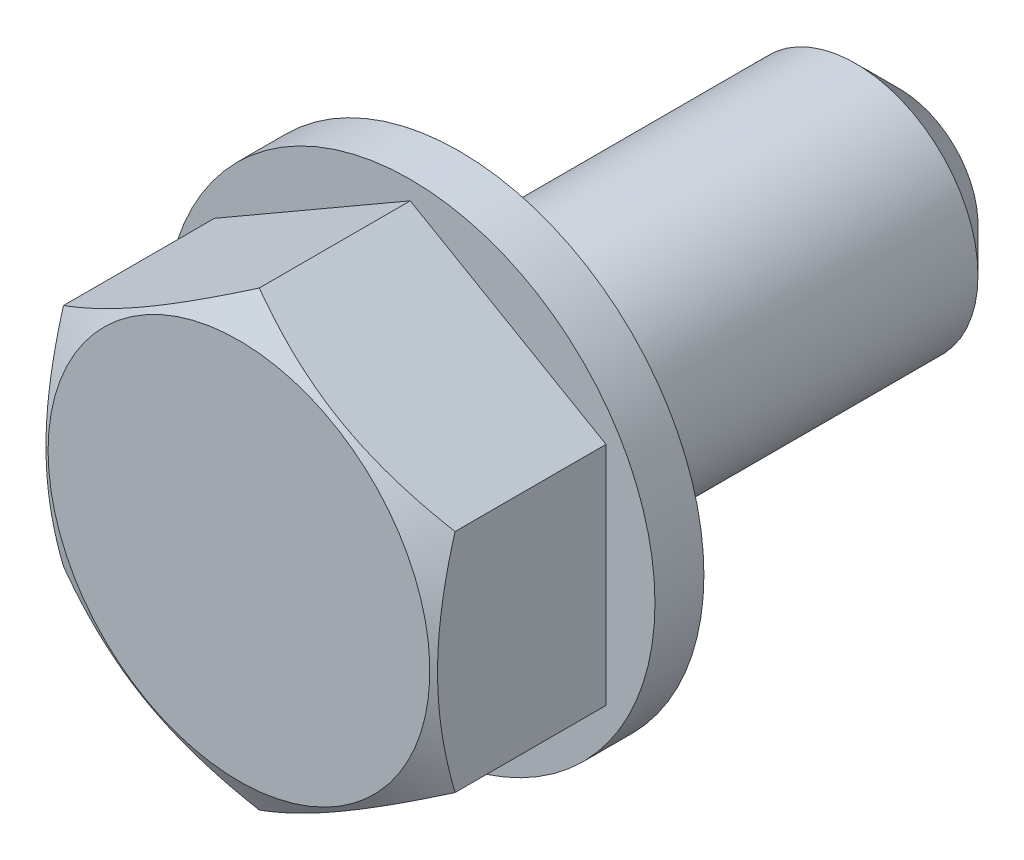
ISO-10303-21;
HEADER;
FILE_DESCRIPTION(('STEP AP214'),'2;1');
FILE_NAME('part.step','',(''),(''),'','','');
FILE_SCHEMA(('AUTOMOTIVE_DESIGN { 1 0 10303 214 1 1 1 1 }'));
ENDSEC;
DATA;
#1=APPLICATION_CONTEXT('core data for automotive mechanical design processes');
#2=APPLICATION_PROTOCOL_DEFINITION('international standard','automotive_design',2000,#1);
#3=PRODUCT_CONTEXT('',#1,'mechanical');
#4=PRODUCT('Part','Part','',(#3));
#5=PRODUCT_RELATED_PRODUCT_CATEGORY('part','',(#4));
#6=PRODUCT_DEFINITION_FORMATION('','',#4);
#7=PRODUCT_DEFINITION_CONTEXT('part definition',#1,'design');
#8=PRODUCT_DEFINITION('design','',#6,#7);
#9=PRODUCT_DEFINITION_SHAPE('','',#8);
#10=(LENGTH_UNIT() NAMED_UNIT(*) SI_UNIT(.MILLI.,.METRE.));
#11=(NAMED_UNIT(*) PLANE_ANGLE_UNIT() SI_UNIT($,.RADIAN.));
#12=(NAMED_UNIT(*) SI_UNIT($,.STERADIAN.) SOLID_ANGLE_UNIT());
#13=UNCERTAINTY_MEASURE_WITH_UNIT(LENGTH_MEASURE(1.E-05),#10,'distance_accuracy_value','');
#14=(GEOMETRIC_REPRESENTATION_CONTEXT(3) GLOBAL_UNCERTAINTY_ASSIGNED_CONTEXT((#13)) GLOBAL_UNIT_ASSIGNED_CONTEXT((#10,
#11,#12)) REPRESENTATION_CONTEXT('',''));
#15=CARTESIAN_POINT('',(0.,0.,0.));
#16=DIRECTION('',(0.,0.,1.));
#17=DIRECTION('',(1.,0.,0.));
#18=AXIS2_PLACEMENT_3D('',#15,#16,#17);
#19=CARTESIAN_POINT('',(0.,4.61880215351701,1.));
#20=DIRECTION('',(0.,0.,1.));
#21=DIRECTION('',(1.,0.,0.));
#22=AXIS2_PLACEMENT_3D('',#19,#20,#21);
#23=PLANE('',#22);
#24=CARTESIAN_POINT('',(0.,0.,1.));
#25=DIRECTION('',(0.,0.,-1.));
#26=DIRECTION('',(-1.,0.,0.));
#27=AXIS2_PLACEMENT_3D('',#24,#25,#26);
#28=CIRCLE('',#27,2.65);
#29=CARTESIAN_POINT('',(-2.65,0.,1.));
#30=VERTEX_POINT('',#29);
#31=EDGE_CURVE('E338',#30,#30,#28,.T.);
#32=ORIENTED_EDGE('',*,*,#31,.T.);
#33=EDGE_LOOP('',(#32));
#34=FACE_BOUND('',#33,.T.);
#35=CARTESIAN_POINT('',(0.,0.,1.));
#36=DIRECTION('',(0.,0.,1.));
#37=DIRECTION('',(1.,0.,0.));
#38=AXIS2_PLACEMENT_3D('',#35,#36,#37);
#39=CIRCLE('',#38,2.5);
#40=CARTESIAN_POINT('',(2.5,0.,1.));
#41=VERTEX_POINT('',#40);
#42=EDGE_CURVE('E102',#41,#41,#39,.F.);
#43=ORIENTED_EDGE('',*,*,#42,.F.);
#44=EDGE_LOOP('',(#43));
#45=FACE_BOUND('',#44,.T.);
#46=ADVANCED_FACE('F14',(#34,#45),#23,.F.);
#47=CARTESIAN_POINT('',(0.,0.,-9.));
#48=DIRECTION('',(0.,0.,1.));
#49=DIRECTION('',(1.,0.,0.));
#50=AXIS2_PLACEMENT_3D('',#47,#48,#49);
#51=CYLINDRICAL_SURFACE('',#50,2.5);
#52=CARTESIAN_POINT('',(0.,0.,-8.1));
#53=DIRECTION('',(0.,0.,-1.));
#54=DIRECTION('',(-1.,0.,0.));
#55=AXIS2_PLACEMENT_3D('',#52,#53,#54);
#56=CIRCLE('',#55,2.5);
#57=CARTESIAN_POINT('',(-2.5,0.,-8.1));
#58=VERTEX_POINT('',#57);
#59=EDGE_CURVE('E9',#58,#58,#56,.F.);
#60=ORIENTED_EDGE('',*,*,#59,.T.);
#61=EDGE_LOOP('',(#60));
#62=FACE_BOUND('',#61,.T.);
#63=ORIENTED_EDGE('',*,*,#42,.T.);
#64=EDGE_LOOP('',(#63));
#65=FACE_BOUND('',#64,.T.);
#66=ADVANCED_FACE('F120',(#62,#65),#51,.T.);
#67=CARTESIAN_POINT('',(0.,0.,-9.));
#68=DIRECTION('',(0.,0.,-1.));
#69=DIRECTION('',(-1.,0.,0.));
#70=AXIS2_PLACEMENT_3D('',#67,#68,#69);
#71=PLANE('',#70);
#72=CARTESIAN_POINT('',(0.,0.,-9.));
#73=DIRECTION('',(0.,0.,-1.));
#74=DIRECTION('',(-1.,0.,0.));
#75=AXIS2_PLACEMENT_3D('',#72,#73,#74);
#76=CIRCLE('',#75,1.6);
#77=CARTESIAN_POINT('',(-1.6,0.,-9.));
#78=VERTEX_POINT('',#77);
#79=EDGE_CURVE('E22',#78,#78,#76,.T.);
#80=ORIENTED_EDGE('',*,*,#79,.T.);
#81=EDGE_LOOP('',(#80));
#82=FACE_BOUND('',#81,.T.);
#83=ADVANCED_FACE('F107',(#82),#71,.T.);
#84=CARTESIAN_POINT('',(0.,0.,-9.));
#85=DIRECTION('',(0.,0.,1.));
#86=DIRECTION('',(1.,0.,0.));
#87=AXIS2_PLACEMENT_3D('',#84,#85,#86);
#88=CONICAL_SURFACE('',#87,1.6,0.785398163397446);
#89=ORIENTED_EDGE('',*,*,#59,.F.);
#90=EDGE_LOOP('',(#89));
#91=FACE_BOUND('',#90,.T.);
#92=ORIENTED_EDGE('',*,*,#79,.F.);
#93=EDGE_LOOP('',(#92));
#94=FACE_BOUND('',#93,.T.);
#95=ADVANCED_FACE('F16',(#91,#94),#88,.T.);
#96=CARTESIAN_POINT('',(0.,0.,1.));
#97=DIRECTION('',(0.,0.,-1.));
#98=DIRECTION('',(-1.,0.,0.));
#99=AXIS2_PLACEMENT_3D('',#96,#97,#98);
#100=PLANE('',#99);
#101=CARTESIAN_POINT('',(0.,0.,1.));
#102=DIRECTION('',(0.,0.,-1.));
#103=DIRECTION('',(-1.,0.,0.));
#104=AXIS2_PLACEMENT_3D('',#101,#102,#103);
#105=CIRCLE('',#104,5.);
#106=CARTESIAN_POINT('',(-5.,0.,1.));
#107=VERTEX_POINT('',#106);
#108=EDGE_CURVE('E337',#107,#107,#105,.T.);
#109=ORIENTED_EDGE('',*,*,#108,.F.);
#110=EDGE_LOOP('',(#109));
#111=FACE_BOUND('',#110,.T.);
#112=DIRECTION('',(-0.866025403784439,-0.5,0.));
#113=VECTOR('',#112,1.);
#114=CARTESIAN_POINT('',(0.,4.61880215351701,1.));
#115=LINE('',#114,#113);
#116=CARTESIAN_POINT('',(0.,4.61880215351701,1.));
#117=VERTEX_POINT('',#116);
#118=CARTESIAN_POINT('',(-4.,2.30940107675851,1.));
#119=VERTEX_POINT('',#118);
#120=EDGE_CURVE('E210',#117,#119,#115,.T.);
#121=ORIENTED_EDGE('',*,*,#120,.F.);
#122=DIRECTION('',(-0.866025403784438,0.5,0.));
#123=VECTOR('',#122,1.);
#124=CARTESIAN_POINT('',(4.,2.30940107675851,1.));
#125=LINE('',#124,#123);
#126=CARTESIAN_POINT('',(4.,2.30940107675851,1.));
#127=VERTEX_POINT('',#126);
#128=EDGE_CURVE('E37',#127,#117,#125,.T.);
#129=ORIENTED_EDGE('',*,*,#128,.F.);
#130=DIRECTION('',(0.,1.,0.));
#131=VECTOR('',#130,1.);
#132=CARTESIAN_POINT('',(4.,-2.30940107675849,1.));
#133=LINE('',#132,#131);
#134=CARTESIAN_POINT('',(4.,-2.30940107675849,1.));
#135=VERTEX_POINT('',#134);
#136=EDGE_CURVE('E65',#135,#127,#133,.T.);
#137=ORIENTED_EDGE('',*,*,#136,.F.);
#138=DIRECTION('',(0.866025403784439,0.5,0.));
#139=VECTOR('',#138,1.);
#140=CARTESIAN_POINT('',(0.,-4.618802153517,1.));
#141=LINE('',#140,#139);
#142=CARTESIAN_POINT('',(0.,-4.618802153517,1.));
#143=VERTEX_POINT('',#142);
#144=EDGE_CURVE('E69',#143,#135,#141,.T.);
#145=ORIENTED_EDGE('',*,*,#144,.F.);
#146=DIRECTION('',(0.866025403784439,-0.5,0.));
#147=VECTOR('',#146,1.);
#148=CARTESIAN_POINT('',(-4.,-2.3094010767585,1.));
#149=LINE('',#148,#147);
#150=CARTESIAN_POINT('',(-4.,-2.3094010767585,1.));
#151=VERTEX_POINT('',#150);
#152=EDGE_CURVE('E85',#151,#143,#149,.T.);
#153=ORIENTED_EDGE('',*,*,#152,.F.);
#154=DIRECTION('',(0.,-1.,0.));
#155=VECTOR('',#154,1.);
#156=CARTESIAN_POINT('',(-4.,2.30940107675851,1.));
#157=LINE('',#156,#155);
#158=EDGE_CURVE('E87',#119,#151,#157,.T.);
#159=ORIENTED_EDGE('',*,*,#158,.F.);
#160=EDGE_LOOP('',(#121,#129,#137,#145,#153,#159));
#161=FACE_BOUND('',#160,.T.);
#162=ADVANCED_FACE('F67',(#111,#161),#100,.F.);
#163=CARTESIAN_POINT('',(0.,0.,0.));
#164=DIRECTION('',(0.,0.,-1.));
#165=DIRECTION('',(-1.,0.,0.));
#166=AXIS2_PLACEMENT_3D('',#163,#164,#165);
#167=PLANE('',#166);
#168=CARTESIAN_POINT('',(0.,0.,0.));
#169=DIRECTION('',(0.,0.,-1.));
#170=DIRECTION('',(-1.,0.,0.));
#171=AXIS2_PLACEMENT_3D('',#168,#169,#170);
#172=CIRCLE('',#171,5.);
#173=CARTESIAN_POINT('',(-5.,0.,0.));
#174=VERTEX_POINT('',#173);
#175=EDGE_CURVE('E333',#174,#174,#172,.T.);
#176=ORIENTED_EDGE('',*,*,#175,.T.);
#177=EDGE_LOOP('',(#176));
#178=FACE_BOUND('',#177,.T.);
#179=CARTESIAN_POINT('',(0.,0.,0.));
#180=DIRECTION('',(0.,0.,-1.));
#181=DIRECTION('',(-1.,0.,0.));
#182=AXIS2_PLACEMENT_3D('',#179,#180,#181);
#183=CIRCLE('',#182,2.65);
#184=CARTESIAN_POINT('',(-2.65,0.,0.));
#185=VERTEX_POINT('',#184);
#186=EDGE_CURVE('E336',#185,#185,#183,.T.);
#187=ORIENTED_EDGE('',*,*,#186,.F.);
#188=EDGE_LOOP('',(#187));
#189=FACE_BOUND('',#188,.T.);
#190=ADVANCED_FACE('F117',(#178,#189),#167,.T.);
#191=CARTESIAN_POINT('',(0.,0.,0.));
#192=DIRECTION('',(0.,0.,1.));
#193=DIRECTION('',(1.,0.,0.));
#194=AXIS2_PLACEMENT_3D('',#191,#192,#193);
#195=CYLINDRICAL_SURFACE('',#194,5.);
#196=ORIENTED_EDGE('',*,*,#175,.F.);
#197=EDGE_LOOP('',(#196));
#198=FACE_BOUND('',#197,.T.);
#199=ORIENTED_EDGE('',*,*,#108,.T.);
#200=EDGE_LOOP('',(#199));
#201=FACE_BOUND('',#200,.T.);
#202=ADVANCED_FACE('F260',(#198,#201),#195,.T.);
#203=CARTESIAN_POINT('',(0.,0.,0.));
#204=DIRECTION('',(0.,0.,1.));
#205=DIRECTION('',(1.,0.,0.));
#206=AXIS2_PLACEMENT_3D('',#203,#204,#205);
#207=CYLINDRICAL_SURFACE('',#206,2.65);
#208=ORIENTED_EDGE('',*,*,#186,.T.);
#209=EDGE_LOOP('',(#208));
#210=FACE_BOUND('',#209,.T.);
#211=ORIENTED_EDGE('',*,*,#31,.F.);
#212=EDGE_LOOP('',(#211));
#213=FACE_BOUND('',#212,.T.);
#214=ADVANCED_FACE('F252',(#210,#213),#207,.F.);
#215=CARTESIAN_POINT('',(0.,4.61880215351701,4.5));
#216=DIRECTION('',(0.,0.,1.));
#217=DIRECTION('',(1.,0.,0.));
#218=AXIS2_PLACEMENT_3D('',#215,#216,#217);
#219=PLANE('',#218);
#220=CARTESIAN_POINT('',(0.,0.,4.5));
#221=DIRECTION('',(0.,0.,-1.));
#222=DIRECTION('',(-1.,0.,0.));
#223=AXIS2_PLACEMENT_3D('',#220,#221,#222);
#224=CIRCLE('',#223,3.9);
#225=CARTESIAN_POINT('',(-3.9,0.,4.5));
#226=VERTEX_POINT('',#225);
#227=EDGE_CURVE('E151',#226,#226,#224,.T.);
#228=ORIENTED_EDGE('',*,*,#227,.F.);
#229=EDGE_LOOP('',(#228));
#230=FACE_BOUND('',#229,.T.);
#231=ADVANCED_FACE('F136',(#230),#219,.T.);
#232=CARTESIAN_POINT('',(0.,0.,4.5));
#233=DIRECTION('',(0.,0.,-1.));
#234=DIRECTION('',(-1.,0.,0.));
#235=AXIS2_PLACEMENT_3D('',#232,#233,#234);
#236=CONICAL_SURFACE('',#235,3.9,1.0471975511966);
#237=ORIENTED_EDGE('',*,*,#227,.T.);
#238=EDGE_LOOP('',(#237));
#239=FACE_BOUND('',#238,.T.);
#240=CARTESIAN_POINT('',(-4.0002,2.30928560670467,4.08493271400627));
#241=CARTESIAN_POINT('',(-3.82442084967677,2.41077174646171,4.14354709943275));
#242=CARTESIAN_POINT('',(-3.64712438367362,2.513133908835,4.19685465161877));
#243=CARTESIAN_POINT('',(-3.2894614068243,2.71963072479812,4.28990330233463));
#244=CARTESIAN_POINT('',(-3.10908854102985,2.82376904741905,4.32961148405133));
#245=CARTESIAN_POINT('',(-2.75057818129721,3.03075510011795,4.39142275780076));
#246=CARTESIAN_POINT('',(-2.57249584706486,3.13357098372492,4.41393724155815));
#247=CARTESIAN_POINT('',(-2.21549328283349,3.33968651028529,4.44081434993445));
#248=CARTESIAN_POINT('',(-2.0365743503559,3.44298540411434,4.44519923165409));
#249=CARTESIAN_POINT('',(-1.70225715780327,3.63600352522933,4.43607490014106));
#250=CARTESIAN_POINT('',(-1.54680884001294,3.72575165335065,4.42480601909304));
#251=CARTESIAN_POINT('',(-1.23692494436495,3.90466320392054,4.38909098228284));
#252=CARTESIAN_POINT('',(-1.08249043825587,3.99382600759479,4.3646326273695));
#253=CARTESIAN_POINT('',(-0.771967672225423,4.17310641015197,4.30348890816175));
#254=CARTESIAN_POINT('',(-0.615918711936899,4.26320131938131,4.26654436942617));
#255=CARTESIAN_POINT('',(-0.306148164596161,4.44204742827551,4.18269490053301));
#256=CARTESIAN_POINT('',(-0.152422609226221,4.53080091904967,4.1358096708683));
#257=CARTESIAN_POINT('',(0.000200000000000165,4.61891762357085,4.08493271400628));
#258=B_SPLINE_CURVE_WITH_KNOTS('',3,(#240,#241,#242,#243,#244,#245,#246,#247,#248,#249,#250,
#251,#252,#253,#254,#255,#256,#257),.UNSPECIFIED.,.F.,.F.,(4,2,2,2,2,2,2,2,4),(0.,
0.634047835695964,1.26961969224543,1.88946157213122,2.50854226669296,3.04757825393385,
3.58711366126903,4.13861653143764,4.68903648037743),.UNSPECIFIED.);
#259=CARTESIAN_POINT('',(-4.,2.30940107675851,4.08499938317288));
#260=VERTEX_POINT('',#259);
#261=CARTESIAN_POINT('',(0.,4.61880215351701,4.08499938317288));
#262=VERTEX_POINT('',#261);
#263=EDGE_CURVE('E180',#260,#262,#258,.T.);
#264=ORIENTED_EDGE('',*,*,#263,.F.);
#265=CARTESIAN_POINT('',(-4.,-6.17235700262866,2.50517765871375));
#266=CARTESIAN_POINT('',(-4.,-5.99790829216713,2.58967588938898));
#267=CARTESIAN_POINT('',(-4.,-5.82305577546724,2.67335489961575));
#268=CARTESIAN_POINT('',(-4.,-5.47232826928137,2.83861309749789));
#269=CARTESIAN_POINT('',(-4.,-5.29645312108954,2.92019194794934));
#270=CARTESIAN_POINT('',(-4.,-4.94254437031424,3.08120552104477));
#271=CARTESIAN_POINT('',(-4.,-4.76450420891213,3.16062587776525));
#272=CARTESIAN_POINT('',(-4.,-4.40699692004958,3.31617476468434));
#273=CARTESIAN_POINT('',(-4.,-4.22752986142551,3.39230345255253));
#274=CARTESIAN_POINT('',(-4.,-3.8612108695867,3.54272825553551));
#275=CARTESIAN_POINT('',(-4.,-3.67430410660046,3.61689158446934));
#276=CARTESIAN_POINT('',(-4.,-3.29829243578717,3.75952985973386));
#277=CARTESIAN_POINT('',(-4.,-3.10918728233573,3.82800416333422));
#278=CARTESIAN_POINT('',(-4.,-2.72884213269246,3.95744408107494));
#279=CARTESIAN_POINT('',(-4.,-2.53760745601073,4.01842516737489));
#280=CARTESIAN_POINT('',(-4.,-2.15239527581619,4.13090140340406));
#281=CARTESIAN_POINT('',(-4.,-1.95841866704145,4.18239957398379));
#282=CARTESIAN_POINT('',(-4.,-1.56868355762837,4.27314592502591));
#283=CARTESIAN_POINT('',(-4.,-1.37294054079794,4.31245937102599));
#284=CARTESIAN_POINT('',(-4.,-0.979053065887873,4.37659279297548));
#285=CARTESIAN_POINT('',(-4.,-0.780908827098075,4.40141408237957));
#286=CARTESIAN_POINT('',(-4.,-0.385783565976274,4.43425752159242));
#287=CARTESIAN_POINT('',(-4.,-0.188820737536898,4.44249317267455));
#288=CARTESIAN_POINT('',(-4.,0.205099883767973,4.44202721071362));
#289=CARTESIAN_POINT('',(-4.,0.402057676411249,4.43332520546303));
#290=CARTESIAN_POINT('',(-4.,0.737360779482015,4.40470401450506));
#291=CARTESIAN_POINT('',(-4.,0.876068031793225,4.38879048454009));
#292=CARTESIAN_POINT('',(-4.,1.15244063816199,4.34957056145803));
#293=CARTESIAN_POINT('',(-4.,1.29010584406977,4.32626313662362));
#294=CARTESIAN_POINT('',(-4.,1.70137012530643,4.24647788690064));
#295=CARTESIAN_POINT('',(-4.,1.97307862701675,4.18015245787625));
#296=CARTESIAN_POINT('',(-4.,2.37931436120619,4.06548108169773));
#297=CARTESIAN_POINT('',(-4.,2.51595588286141,4.02420156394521));
#298=CARTESIAN_POINT('',(-4.,2.78791095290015,3.93743995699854));
#299=CARTESIAN_POINT('',(-4.,2.92322449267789,3.8919578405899));
#300=CARTESIAN_POINT('',(-4.,3.19256812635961,3.79751382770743));
#301=CARTESIAN_POINT('',(-4.,3.32659864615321,3.74855313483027));
#302=CARTESIAN_POINT('',(-4.,3.59355496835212,3.64771949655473));
#303=CARTESIAN_POINT('',(-4.,3.72648078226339,3.59584658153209));
#304=CARTESIAN_POINT('',(-4.,4.03418177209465,3.47250498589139));
#305=CARTESIAN_POINT('',(-4.,4.20859041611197,3.40012373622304));
#306=CARTESIAN_POINT('',(-4.,4.55597393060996,3.25198978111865));
#307=CARTESIAN_POINT('',(-4.,4.72894872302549,3.17623689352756));
#308=CARTESIAN_POINT('',(-4.,5.07372113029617,3.02202080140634));
#309=CARTESIAN_POINT('',(-4.,5.24551852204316,2.94355709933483));
#310=CARTESIAN_POINT('',(-4.,5.58809992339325,2.78444459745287));
#311=CARTESIAN_POINT('',(-4.,5.7588839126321,2.70379575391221));
#312=CARTESIAN_POINT('',(-4.,6.27027884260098,2.45904377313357));
#313=CARTESIAN_POINT('',(-4.,6.60961530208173,2.29227908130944));
#314=CARTESIAN_POINT('',(-4.,7.28586348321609,1.95390567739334));
#315=CARTESIAN_POINT('',(-4.,7.62277511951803,1.78229679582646));
#316=CARTESIAN_POINT('',(-4.,8.26760080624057,1.44965287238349));
#317=CARTESIAN_POINT('',(-4.,8.57565387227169,1.28888681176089));
#318=CARTESIAN_POINT('',(-4.,9.19060889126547,0.965147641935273));
#319=CARTESIAN_POINT('',(-4.,9.49751080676,0.802174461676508));
#320=CARTESIAN_POINT('',(-4.,10.1096920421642,0.474923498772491));
#321=CARTESIAN_POINT('',(-4.,10.4149734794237,0.310649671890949));
#322=CARTESIAN_POINT('',(-4.,11.0247966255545,-0.0192281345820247));
#323=CARTESIAN_POINT('',(-4.,11.3293383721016,-0.184832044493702));
#324=CARTESIAN_POINT('',(-4.,11.6336061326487,-0.350934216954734));
#325=B_SPLINE_CURVE_WITH_KNOTS('',3,(#265,#266,#267,#268,#269,#270,#271,#272,#273,#274,#275,
#276,#277,#278,#279,#280,#281,#282,#283,#284,#285,#286,#287,#288,#289,#290,#291,#292,#293,#294,
#295,#296,#297,#298,#299,#300,#301,#302,#303,#304,#305,#306,#307,#308,#309,#310,#311,#312,#313,
#314,#315,#316,#317,#318,#319,#320,#321,#322,#323,#324),.UNSPECIFIED.,.F.,.F.,(4,2,2,2,2,2,2,2,
2,2,2,2,2,2,2,2,2,2,2,2,2,2,2,2,2,2,2,2,2,4),(0.,0.581514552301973,1.16312189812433,
1.74794823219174,2.33274652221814,2.93592370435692,3.53916893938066,4.14114686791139,
4.74293269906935,5.34143711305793,5.93988727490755,6.53058324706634,7.12129289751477,
7.53994056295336,7.95864667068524,8.79653664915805,9.22472357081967,9.65291326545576,
10.0809555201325,10.508993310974,11.0754413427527,11.6419200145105,12.2085032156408,
12.7750977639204,13.9093322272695,15.0436064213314,16.0860349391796,17.1284970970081,
18.1685145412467,19.2084778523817),.UNSPECIFIED.);
#326=CARTESIAN_POINT('',(-4.,-2.3094010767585,4.08499938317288));
#327=VERTEX_POINT('',#326);
#328=EDGE_CURVE('E173',#327,#260,#325,.T.);
#329=ORIENTED_EDGE('',*,*,#328,.F.);
#330=CARTESIAN_POINT('',(0.000199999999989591,-4.61891762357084,4.08493271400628));
#331=CARTESIAN_POINT('',(-0.175579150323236,-4.5174314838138,4.14354709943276));
#332=CARTESIAN_POINT('',(-0.352875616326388,-4.41506932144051,4.19685465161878));
#333=CARTESIAN_POINT('',(-0.710538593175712,-4.20857250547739,4.28990330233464));
#334=CARTESIAN_POINT('',(-0.890911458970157,-4.10443418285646,4.32961148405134));
#335=CARTESIAN_POINT('',(-1.24942181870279,-3.89744813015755,4.39142275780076));
#336=CARTESIAN_POINT('',(-1.42750415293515,-3.79463224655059,4.41393724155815));
#337=CARTESIAN_POINT('',(-1.78450671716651,-3.58851671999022,4.44081434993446));
#338=CARTESIAN_POINT('',(-1.96342564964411,-3.48521782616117,4.4451992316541));
#339=CARTESIAN_POINT('',(-2.29774284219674,-3.29219970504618,4.43607490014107));
#340=CARTESIAN_POINT('',(-2.45319115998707,-3.20245157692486,4.42480601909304));
#341=CARTESIAN_POINT('',(-2.76307505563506,-3.02354002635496,4.38909098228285));
#342=CARTESIAN_POINT('',(-2.91750956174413,-2.93437722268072,4.36463262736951));
#343=CARTESIAN_POINT('',(-3.22803232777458,-2.75509682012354,4.30348890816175));
#344=CARTESIAN_POINT('',(-3.3840812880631,-2.66500191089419,4.26654436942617));
#345=CARTESIAN_POINT('',(-3.69385183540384,-2.486155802,4.18269490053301));
#346=CARTESIAN_POINT('',(-3.84757739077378,-2.39740231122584,4.1358096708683));
#347=CARTESIAN_POINT('',(-4.0002,-2.30928560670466,4.08493271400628));
#348=B_SPLINE_CURVE_WITH_KNOTS('',3,(#330,#331,#332,#333,#334,#335,#336,#337,#338,#339,#340,
#341,#342,#343,#344,#345,#346,#347),.UNSPECIFIED.,.F.,.F.,(4,2,2,2,2,2,2,2,4),(0.,
0.634047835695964,1.26961969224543,1.88946157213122,2.50854226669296,3.04757825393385,
3.58711366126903,4.13861653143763,4.68903648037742),.UNSPECIFIED.);
#349=CARTESIAN_POINT('',(0.,-4.618802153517,4.08499938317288));
#350=VERTEX_POINT('',#349);
#351=EDGE_CURVE('E167',#350,#327,#348,.T.);
#352=ORIENTED_EDGE('',*,*,#351,.F.);
#353=CARTESIAN_POINT('',(4.0002,-2.30928560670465,4.08493271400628));
#354=CARTESIAN_POINT('',(3.82442084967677,-2.41077174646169,4.14354709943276));
#355=CARTESIAN_POINT('',(3.64712438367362,-2.51313390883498,4.19685465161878));
#356=CARTESIAN_POINT('',(3.28946140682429,-2.7196307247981,4.28990330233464));
#357=CARTESIAN_POINT('',(3.10908854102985,-2.82376904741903,4.32961148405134));
#358=CARTESIAN_POINT('',(2.75057818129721,-3.03075510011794,4.39142275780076));
#359=CARTESIAN_POINT('',(2.57249584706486,-3.1335709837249,4.41393724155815));
#360=CARTESIAN_POINT('',(2.21549328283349,-3.33968651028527,4.44081434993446));
#361=CARTESIAN_POINT('',(2.0365743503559,-3.44298540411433,4.4451992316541));
#362=CARTESIAN_POINT('',(1.70225715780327,-3.63600352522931,4.43607490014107));
#363=CARTESIAN_POINT('',(1.54680884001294,-3.72575165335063,4.42480601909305));
#364=CARTESIAN_POINT('',(1.23692494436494,-3.90466320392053,4.38909098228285));
#365=CARTESIAN_POINT('',(1.08249043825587,-3.99382600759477,4.36463262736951));
#366=CARTESIAN_POINT('',(0.771967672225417,-4.17310641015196,4.30348890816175));
#367=CARTESIAN_POINT('',(0.615918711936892,-4.2632013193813,4.26654436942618));
#368=CARTESIAN_POINT('',(0.306148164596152,-4.4420474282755,4.18269490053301));
#369=CARTESIAN_POINT('',(0.152422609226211,-4.53080091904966,4.1358096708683));
#370=CARTESIAN_POINT('',(-0.00020000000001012,-4.61891762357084,4.08493271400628));
#371=B_SPLINE_CURVE_WITH_KNOTS('',3,(#353,#354,#355,#356,#357,#358,#359,#360,#361,#362,#363,
#364,#365,#366,#367,#368,#369,#370),.UNSPECIFIED.,.F.,.F.,(4,2,2,2,2,2,2,2,4),(0.,
0.634047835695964,1.26961969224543,1.88946157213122,2.50854226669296,3.04757825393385,
3.58711366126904,4.13861653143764,4.68903648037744),.UNSPECIFIED.);
#372=CARTESIAN_POINT('',(4.,-2.30940107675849,4.08499938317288));
#373=VERTEX_POINT('',#372);
#374=EDGE_CURVE('E29',#373,#350,#371,.T.);
#375=ORIENTED_EDGE('',*,*,#374,.F.);
#376=CARTESIAN_POINT('',(4.,-6.17235700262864,2.50517765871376));
#377=CARTESIAN_POINT('',(4.,-5.99790829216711,2.58967588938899));
#378=CARTESIAN_POINT('',(4.,-5.82305577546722,2.67335489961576));
#379=CARTESIAN_POINT('',(4.,-5.47232826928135,2.83861309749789));
#380=CARTESIAN_POINT('',(4.,-5.29645312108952,2.92019194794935));
#381=CARTESIAN_POINT('',(4.,-4.94254437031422,3.08120552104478));
#382=CARTESIAN_POINT('',(4.,-4.76450420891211,3.16062587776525));
#383=CARTESIAN_POINT('',(4.,-4.40699692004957,3.31617476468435));
#384=CARTESIAN_POINT('',(4.,-4.2275298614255,3.39230345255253));
#385=CARTESIAN_POINT('',(4.,-3.86121086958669,3.54272825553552));
#386=CARTESIAN_POINT('',(4.,-3.67430410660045,3.61689158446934));
#387=CARTESIAN_POINT('',(4.,-3.29829243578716,3.75952985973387));
#388=CARTESIAN_POINT('',(4.,-3.10918728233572,3.82800416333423));
#389=CARTESIAN_POINT('',(4.,-2.72884213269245,3.95744408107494));
#390=CARTESIAN_POINT('',(4.,-2.53760745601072,4.01842516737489));
#391=CARTESIAN_POINT('',(4.,-2.15239527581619,4.13090140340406));
#392=CARTESIAN_POINT('',(4.,-1.95841866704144,4.1823995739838));
#393=CARTESIAN_POINT('',(4.,-1.56868355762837,4.27314592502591));
#394=CARTESIAN_POINT('',(4.,-1.37294054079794,4.31245937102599));
#395=CARTESIAN_POINT('',(4.,-0.97905306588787,4.37659279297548));
#396=CARTESIAN_POINT('',(4.,-0.780908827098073,4.40141408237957));
#397=CARTESIAN_POINT('',(4.,-0.385783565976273,4.43425752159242));
#398=CARTESIAN_POINT('',(4.,-0.188820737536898,4.44249317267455));
#399=CARTESIAN_POINT('',(4.,0.205099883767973,4.44202721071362));
#400=CARTESIAN_POINT('',(4.,0.40205767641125,4.43332520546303));
#401=CARTESIAN_POINT('',(4.,0.737360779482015,4.40470401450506));
#402=CARTESIAN_POINT('',(4.,0.876068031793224,4.38879048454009));
#403=CARTESIAN_POINT('',(4.,1.15244063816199,4.34957056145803));
#404=CARTESIAN_POINT('',(4.,1.29010584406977,4.32626313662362));
#405=CARTESIAN_POINT('',(4.,1.70137012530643,4.24647788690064));
#406=CARTESIAN_POINT('',(4.,1.97307862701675,4.18015245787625));
#407=CARTESIAN_POINT('',(4.,2.37931436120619,4.06548108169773));
#408=CARTESIAN_POINT('',(4.,2.5159558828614,4.02420156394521));
#409=CARTESIAN_POINT('',(4.,2.78791095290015,3.93743995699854));
#410=CARTESIAN_POINT('',(4.,2.92322449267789,3.8919578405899));
#411=CARTESIAN_POINT('',(4.,3.19256812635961,3.79751382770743));
#412=CARTESIAN_POINT('',(4.,3.3265986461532,3.74855313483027));
#413=CARTESIAN_POINT('',(4.,3.59355496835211,3.64771949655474));
#414=CARTESIAN_POINT('',(4.,3.72648078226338,3.59584658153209));
#415=CARTESIAN_POINT('',(4.,4.03418177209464,3.47250498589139));
#416=CARTESIAN_POINT('',(4.,4.20859041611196,3.40012373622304));
#417=CARTESIAN_POINT('',(4.,4.55597393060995,3.25198978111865));
#418=CARTESIAN_POINT('',(4.,4.72894872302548,3.17623689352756));
#419=CARTESIAN_POINT('',(4.,5.07372113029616,3.02202080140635));
#420=CARTESIAN_POINT('',(4.,5.24551852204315,2.94355709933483));
#421=CARTESIAN_POINT('',(4.,5.58809992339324,2.78444459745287));
#422=CARTESIAN_POINT('',(4.,5.75888391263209,2.70379575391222));
#423=CARTESIAN_POINT('',(4.,6.27027884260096,2.45904377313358));
#424=CARTESIAN_POINT('',(4.,6.60961530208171,2.29227908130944));
#425=CARTESIAN_POINT('',(4.,7.28586348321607,1.95390567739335));
#426=CARTESIAN_POINT('',(4.,7.622775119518,1.78229679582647));
#427=CARTESIAN_POINT('',(4.,8.26760080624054,1.44965287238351));
#428=CARTESIAN_POINT('',(4.,8.57565387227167,1.2888868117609));
#429=CARTESIAN_POINT('',(4.,9.19060889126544,0.965147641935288));
#430=CARTESIAN_POINT('',(4.,9.49751080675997,0.802174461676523));
#431=CARTESIAN_POINT('',(4.,10.1096920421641,0.474923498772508));
#432=CARTESIAN_POINT('',(4.,10.4149734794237,0.310649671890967));
#433=CARTESIAN_POINT('',(4.,11.0247966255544,-0.0192281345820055));
#434=CARTESIAN_POINT('',(4.,11.3293383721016,-0.184832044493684));
#435=CARTESIAN_POINT('',(4.,11.6336061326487,-0.350934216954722));
#436=B_SPLINE_CURVE_WITH_KNOTS('',3,(#376,#377,#378,#379,#380,#381,#382,#383,#384,#385,#386,
#387,#388,#389,#390,#391,#392,#393,#394,#395,#396,#397,#398,#399,#400,#401,#402,#403,#404,#405,
#406,#407,#408,#409,#410,#411,#412,#413,#414,#415,#416,#417,#418,#419,#420,#421,#422,#423,#424,
#425,#426,#427,#428,#429,#430,#431,#432,#433,#434,#435),.UNSPECIFIED.,.F.,.F.,(4,2,2,2,2,2,2,2,
2,2,2,2,2,2,2,2,2,2,2,2,2,2,2,2,2,2,2,2,2,4),(0.,0.581514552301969,1.16312189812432,
1.74794823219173,2.33274652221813,2.93592370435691,3.53916893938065,4.14114686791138,
4.74293269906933,5.34143711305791,5.93988727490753,6.53058324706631,7.12129289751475,
7.53994056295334,7.95864667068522,8.79653664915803,9.22472357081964,9.65291326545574,
10.0809555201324,10.508993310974,11.0754413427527,11.6419200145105,12.2085032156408,
12.7750977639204,13.9093322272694,15.0436064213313,16.0860349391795,17.128497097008,
18.1685145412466,19.2084778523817),.UNSPECIFIED.);
#437=CARTESIAN_POINT('',(4.,2.30940107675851,4.08499938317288));
#438=VERTEX_POINT('',#437);
#439=EDGE_CURVE('E78',#438,#373,#436,.F.);
#440=ORIENTED_EDGE('',*,*,#439,.F.);
#441=CARTESIAN_POINT('',(-0.000199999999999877,4.61891762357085,4.08493271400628));
#442=CARTESIAN_POINT('',(0.175579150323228,4.51743148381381,4.14354709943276));
#443=CARTESIAN_POINT('',(0.352875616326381,4.41506932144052,4.19685465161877));
#444=CARTESIAN_POINT('',(0.710538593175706,4.2085725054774,4.28990330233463));
#445=CARTESIAN_POINT('',(0.890911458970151,4.10443418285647,4.32961148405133));
#446=CARTESIAN_POINT('',(1.24942181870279,3.89744813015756,4.39142275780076));
#447=CARTESIAN_POINT('',(1.42750415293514,3.7946322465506,4.41393724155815));
#448=CARTESIAN_POINT('',(1.78450671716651,3.58851671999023,4.44081434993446));
#449=CARTESIAN_POINT('',(1.9634256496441,3.48521782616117,4.4451992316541));
#450=CARTESIAN_POINT('',(2.29774284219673,3.29219970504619,4.43607490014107));
#451=CARTESIAN_POINT('',(2.45319115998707,3.20245157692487,4.42480601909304));
#452=CARTESIAN_POINT('',(2.76307505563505,3.02354002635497,4.38909098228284));
#453=CARTESIAN_POINT('',(2.91750956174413,2.93437722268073,4.3646326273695));
#454=CARTESIAN_POINT('',(3.22803232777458,2.75509682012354,4.30348890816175));
#455=CARTESIAN_POINT('',(3.3840812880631,2.6650019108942,4.26654436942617));
#456=CARTESIAN_POINT('',(3.69385183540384,2.48615580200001,4.18269490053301));
#457=CARTESIAN_POINT('',(3.84757739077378,2.39740231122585,4.1358096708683));
#458=CARTESIAN_POINT('',(4.0002,2.30928560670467,4.08493271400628));
#459=B_SPLINE_CURVE_WITH_KNOTS('',3,(#441,#442,#443,#444,#445,#446,#447,#448,#449,#450,#451,
#452,#453,#454,#455,#456,#457,#458),.UNSPECIFIED.,.F.,.F.,(4,2,2,2,2,2,2,2,4),(0.,
0.634047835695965,1.26961969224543,1.88946157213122,2.50854226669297,3.04757825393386,
3.58711366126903,4.13861653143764,4.68903648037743),.UNSPECIFIED.);
#460=EDGE_CURVE('E187',#262,#438,#459,.T.);
#461=ORIENTED_EDGE('',*,*,#460,.F.);
#462=EDGE_LOOP('',(#264,#329,#352,#375,#440,#461));
#463=FACE_BOUND('',#462,.T.);
#464=ADVANCED_FACE('F141',(#239,#463),#236,.T.);
#465=CARTESIAN_POINT('',(4.,-2.30940107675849,4.5));
#466=DIRECTION('',(-1.,0.,0.));
#467=DIRECTION('',(0.,0.,1.));
#468=AXIS2_PLACEMENT_3D('',#465,#466,#467);
#469=PLANE('',#468);
#470=DIRECTION('',(0.,0.,-1.));
#471=VECTOR('',#470,1.);
#472=CARTESIAN_POINT('',(4.,2.30940107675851,4.5));
#473=LINE('',#472,#471);
#474=EDGE_CURVE('E73',#438,#127,#473,.T.);
#475=ORIENTED_EDGE('',*,*,#474,.F.);
#476=ORIENTED_EDGE('',*,*,#439,.T.);
#477=DIRECTION('',(0.,0.,-1.));
#478=VECTOR('',#477,1.);
#479=CARTESIAN_POINT('',(4.,-2.30940107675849,4.5));
#480=LINE('',#479,#478);
#481=EDGE_CURVE('E76',#373,#135,#480,.T.);
#482=ORIENTED_EDGE('',*,*,#481,.T.);
#483=ORIENTED_EDGE('',*,*,#136,.T.);
#484=EDGE_LOOP('',(#475,#476,#482,#483));
#485=FACE_BOUND('',#484,.T.);
#486=ADVANCED_FACE('F77',(#485),#469,.F.);
#487=CARTESIAN_POINT('',(0.,-4.618802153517,4.5));
#488=DIRECTION('',(-0.5,0.866025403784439,0.));
#489=DIRECTION('',(-0.866025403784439,-0.5,0.));
#490=AXIS2_PLACEMENT_3D('',#487,#488,#489);
#491=PLANE('',#490);
#492=ORIENTED_EDGE('',*,*,#481,.F.);
#493=ORIENTED_EDGE('',*,*,#374,.T.);
#494=DIRECTION('',(0.,0.,-1.));
#495=VECTOR('',#494,1.);
#496=CARTESIAN_POINT('',(0.,-4.618802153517,4.5));
#497=LINE('',#496,#495);
#498=EDGE_CURVE('E80',#350,#143,#497,.T.);
#499=ORIENTED_EDGE('',*,*,#498,.T.);
#500=ORIENTED_EDGE('',*,*,#144,.T.);
#501=EDGE_LOOP('',(#492,#493,#499,#500));
#502=FACE_BOUND('',#501,.T.);
#503=ADVANCED_FACE('F82',(#502),#491,.F.);
#504=CARTESIAN_POINT('',(-4.,-2.3094010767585,4.5));
#505=DIRECTION('',(0.5,0.866025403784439,0.));
#506=DIRECTION('',(-0.866025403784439,0.5,0.));
#507=AXIS2_PLACEMENT_3D('',#504,#505,#506);
#508=PLANE('',#507);
#509=ORIENTED_EDGE('',*,*,#498,.F.);
#510=ORIENTED_EDGE('',*,*,#351,.T.);
#511=DIRECTION('',(0.,0.,-1.));
#512=VECTOR('',#511,1.);
#513=CARTESIAN_POINT('',(-4.,-2.3094010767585,4.5));
#514=LINE('',#513,#512);
#515=EDGE_CURVE('E93',#327,#151,#514,.T.);
#516=ORIENTED_EDGE('',*,*,#515,.T.);
#517=ORIENTED_EDGE('',*,*,#152,.T.);
#518=EDGE_LOOP('',(#509,#510,#516,#517));
#519=FACE_BOUND('',#518,.T.);
#520=ADVANCED_FACE('F217',(#519),#508,.F.);
#521=CARTESIAN_POINT('',(-4.,2.30940107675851,4.5));
#522=DIRECTION('',(1.,0.,0.));
#523=DIRECTION('',(0.,0.,-1.));
#524=AXIS2_PLACEMENT_3D('',#521,#522,#523);
#525=PLANE('',#524);
#526=ORIENTED_EDGE('',*,*,#515,.F.);
#527=ORIENTED_EDGE('',*,*,#328,.T.);
#528=DIRECTION('',(0.,0.,-1.));
#529=VECTOR('',#528,1.);
#530=CARTESIAN_POINT('',(-4.,2.30940107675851,4.5));
#531=LINE('',#530,#529);
#532=EDGE_CURVE('E96',#260,#119,#531,.T.);
#533=ORIENTED_EDGE('',*,*,#532,.T.);
#534=ORIENTED_EDGE('',*,*,#158,.T.);
#535=EDGE_LOOP('',(#526,#527,#533,#534));
#536=FACE_BOUND('',#535,.T.);
#537=ADVANCED_FACE('F197',(#536),#525,.F.);
#538=CARTESIAN_POINT('',(0.,4.61880215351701,4.5));
#539=DIRECTION('',(0.5,-0.866025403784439,0.));
#540=DIRECTION('',(0.866025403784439,0.5,0.));
#541=AXIS2_PLACEMENT_3D('',#538,#539,#540);
#542=PLANE('',#541);
#543=ORIENTED_EDGE('',*,*,#532,.F.);
#544=ORIENTED_EDGE('',*,*,#263,.T.);
#545=DIRECTION('',(0.,0.,-1.));
#546=VECTOR('',#545,1.);
#547=CARTESIAN_POINT('',(0.,4.61880215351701,4.5));
#548=LINE('',#547,#546);
#549=EDGE_CURVE('E99',#262,#117,#548,.T.);
#550=ORIENTED_EDGE('',*,*,#549,.T.);
#551=ORIENTED_EDGE('',*,*,#120,.T.);
#552=EDGE_LOOP('',(#543,#544,#550,#551));
#553=FACE_BOUND('',#552,.T.);
#554=ADVANCED_FACE('F193',(#553),#542,.F.);
#555=CARTESIAN_POINT('',(4.,2.30940107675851,4.5));
#556=DIRECTION('',(-0.5,-0.866025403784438,0.));
#557=DIRECTION('',(0.866025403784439,-0.5,0.));
#558=AXIS2_PLACEMENT_3D('',#555,#556,#557);
#559=PLANE('',#558);
#560=ORIENTED_EDGE('',*,*,#549,.F.);
#561=ORIENTED_EDGE('',*,*,#460,.T.);
#562=ORIENTED_EDGE('',*,*,#474,.T.);
#563=ORIENTED_EDGE('',*,*,#128,.T.);
#564=EDGE_LOOP('',(#560,#561,#562,#563));
#565=FACE_BOUND('',#564,.T.);
#566=ADVANCED_FACE('F196',(#565),#559,.F.);
#567=CLOSED_SHELL('',(#46,#66,#83,#95,#162,#190,#202,#214,#231,#464,#486,#503,#520,#537,#554,#566));
#568=MANIFOLD_SOLID_BREP('B1',#567);
#569=ADVANCED_BREP_SHAPE_REPRESENTATION('',(#18,#568),#14);
#570=SHAPE_DEFINITION_REPRESENTATION(#9,#569);
ENDSEC;
END-ISO-10303-21;
